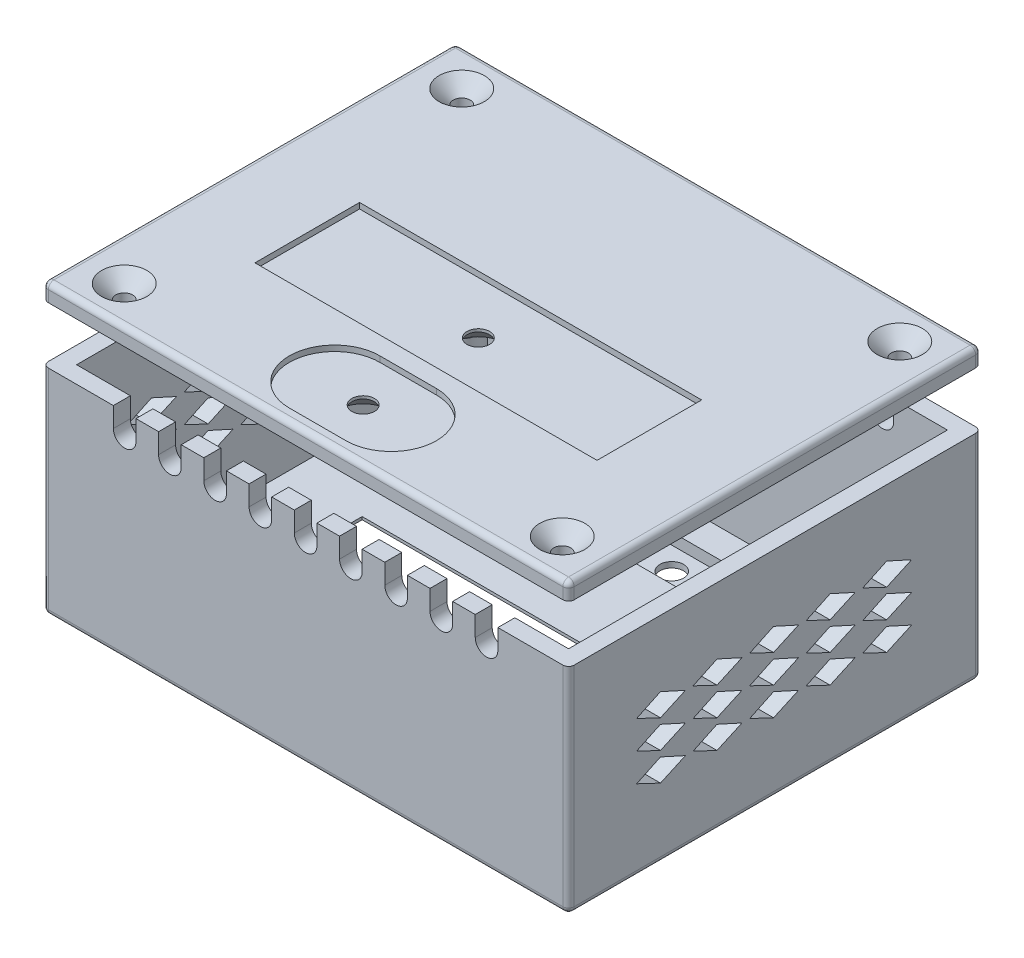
from build123d import *
from OCP.BRepFilletAPI import BRepFilletAPI_MakeChamfer

# Parameters (mm, degrees)
SKETCH_227_W            = 93
SKETCH_227_H            = 73
SKETCH_227_W_2          = 87
SKETCH_227_H_2          = 67
EXTRUDE_477_DEPTH       = 35
SKETCH_2_W              = 93
SKETCH_2_H              = 73
EXTRUDE_524_DEPTH       = 3
SKETCH_1_W              = 60
SKETCH_1_H              = 31
CUT_EXTRUDE_2861_DEPTH  = 3
EXTRUDE_3678_DEPTH      = 2
EXTRUDE_3678_DEPTH_BACK = 3
SKETCH_2_2_R            = 3
SKETCH_2_2_R_2          = 1.5
CHAMFER_3737_SIZE       = 2.5
CHAMFER_3737_SIZE2      = 3
SKETCH_1_3_W            = 28
SKETCH_1_3_H            = 8
CUT_EXTRUDE_1_DEPTH     = 2
SKETCH_1_4_R            = 2.1
CUT_EXTRUDE_2_DEPTH     = 69.698617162
SKETCH_1_5_R            = 1.25
EXTRUDE_3_DEPTH         = 5
FILLET_4_R              = 1
SKETCH_4203_R           = 3.25
SKETCH_4203_R_2         = 1.5
EXTRUDE_5_DEPTH         = 12
CUT_EXTRUDE_4_DEPTH     = 129.932152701
CUT_EXTRUDE_5_DEPTH     = 94.360859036
FILLET_2_R              = 1
SKETCH_7_W              = 93
SKETCH_7_H              = 73
SKETCH_7_R              = 1.5
EXTRUDE_7965_DEPTH      = 3
EXTRUDE_START           = -1
SKETCH_7_3_W            = 86
SKETCH_7_3_H            = 66
SKETCH_7_3_R            = 1.5
EXTRUDE_2_DEPTH         = 1
FILLET_3_R              = 1
CHAMFER_2_SIZE          = 2.5
SKETCH_4_W              = 60.5
SKETCH_4_H              = 18.5
CUT_EXTRUDE_1_2_DEPTH   = 1
SKETCH_4_3_R            = 2
CUT_EXTRUDE_2_2_DEPTH   = 5
CHAMFER_3_SIZE          = 2.5
SKETCH_8_W              = 2.198076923
SKETCH_8_H              = 1.058333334
CUT_EXTRUDE_9799_DEPTH  = 1


with BuildPart() as part:
    # Sketch 227 → Extrude 477 (new body)
    with BuildSketch(Plane(origin=(0, 0, 0), x_dir=(1, 0, 0), z_dir=(0, 1, 0))):
        Rectangle(SKETCH_227_W, SKETCH_227_H)
        Rectangle(SKETCH_227_W_2, SKETCH_227_H_2, mode=Mode.SUBTRACT)
    extrude(amount=EXTRUDE_477_DEPTH)

    # Sketch 2 → Extrude 524 (add)
    with BuildSketch(Plane(origin=(0, 0, 0), x_dir=(1, 0, 0), z_dir=(0, 1, 0))):
        Rectangle(SKETCH_2_W, SKETCH_2_H)
    extrude(amount=-EXTRUDE_524_DEPTH)

    # Sketch 1 → Cut-Extrude 2861 (cut)
    with BuildSketch(Plane.XZ):
        with Locations((0, 12)):
            Rectangle(SKETCH_1_W, SKETCH_1_H)
    extrude(amount=CUT_EXTRUDE_2861_DEPTH, mode=Mode.SUBTRACT)

    # Sketch 2 2 → Extrude 3678 (add, two sides: drawn at the far end of the back side and taken through both)
    # profile 1 of 4: a face of its own
    with BuildSketch(Plane.XZ.offset(-EXTRUDE_3678_DEPTH_BACK)):
        with Locations(Location((-32.75, -12.5, 0), (0, 0, 270))):
            Circle(SKETCH_2_2_R)
        with Locations(Location((-32.75, -12.5, 0), (0, 0, 270))):
            Circle(SKETCH_2_2_R_2, mode=Mode.SUBTRACT)
    # profile 2 of 4: a face of its own
    with BuildSketch(Plane.XZ.offset(-EXTRUDE_3678_DEPTH_BACK)):
        with Locations(Location((32.75, -12.5, 0), (0, 0, 90))):
            Circle(SKETCH_2_2_R)
        with Locations(Location((32.75, -12.5, 0), (0, 0, 90))):
            Circle(SKETCH_2_2_R_2, mode=Mode.SUBTRACT)
    # profile 3 of 4: a face of its own
    with BuildSketch(Plane.XZ.offset(-EXTRUDE_3678_DEPTH_BACK)):
        with BuildLine():
            Line((-34.471932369, 32.956613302), (-31.028067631, 32.956613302))
            ThreePointArc((-31.028067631, 32.956613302), (-32.75, 27.5), (-34.471932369, 32.956613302))
        make_face()
        with Locations(Location((-32.75, 30.5, 0), (0, 0, 270))):
            Circle(SKETCH_2_2_R_2, mode=Mode.SUBTRACT)
    # profile 4 of 4: a face of its own
    with BuildSketch(Plane.XZ.offset(-EXTRUDE_3678_DEPTH_BACK)):
        with BuildLine():
            Line((34.471932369, 32.956613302), (31.028067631, 32.956613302))
            ThreePointArc((31.028067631, 32.956613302), (32.75, 27.5), (34.471932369, 32.956613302))
        make_face()
        with Locations(Location((32.75, 30.5, 0), (0, 0, 90))):
            Circle(SKETCH_2_2_R_2, mode=Mode.SUBTRACT)
    extrude(amount=EXTRUDE_3678_DEPTH + EXTRUDE_3678_DEPTH_BACK)

    # Chamfer 3737: one chamfer whose edges measure the first distance from different faces: ONE call of the kernel's chamfer builder (chamfer() names one face for all edges)
    chamfer_3737_edges_1 = [part.edges().sort_by_distance(p)[0] for p in [
        (30, -3, 12),
    ]]
    chamfer_3737_side_1 = [part.faces().sort_by_distance(p)[0] for p in [
        (30, -1.5, 12),
    ]]
    chamfer_3737_edges_2 = [part.edges().sort_by_distance(p)[0] for p in [
        (0, -3, 27.5),
    ]]
    chamfer_3737_side_2 = [part.faces().sort_by_distance(p)[0] for p in [
        (0, -1.5, 27.5),
    ]]
    chamfer_3737_edges_3 = [part.edges().sort_by_distance(p)[0] for p in [
        (-30, -3, 12),
    ]]
    chamfer_3737_side_3 = [part.faces().sort_by_distance(p)[0] for p in [
        (-30, -1.5, 12),
    ]]
    chamfer_3737_edges_4 = [part.edges().sort_by_distance(p)[0] for p in [
        (0, -3, -3.5),
    ]]
    chamfer_3737_side_4 = [part.faces().sort_by_distance(p)[0] for p in [
        (0, -1.5, -3.5),
    ]]
    chamfer_3737 = BRepFilletAPI_MakeChamfer(part.part.solid().wrapped)
    for e in chamfer_3737_edges_1:
        chamfer_3737.Add(CHAMFER_3737_SIZE, CHAMFER_3737_SIZE2, e.wrapped, chamfer_3737_side_1[0].wrapped)  # the first distance lies on this face
    for e in chamfer_3737_edges_2:
        chamfer_3737.Add(CHAMFER_3737_SIZE, CHAMFER_3737_SIZE2, e.wrapped, chamfer_3737_side_2[0].wrapped)  # the first distance lies on this face
    for e in chamfer_3737_edges_3:
        chamfer_3737.Add(CHAMFER_3737_SIZE, CHAMFER_3737_SIZE2, e.wrapped, chamfer_3737_side_3[0].wrapped)  # the first distance lies on this face
    for e in chamfer_3737_edges_4:
        chamfer_3737.Add(CHAMFER_3737_SIZE, CHAMFER_3737_SIZE2, e.wrapped, chamfer_3737_side_4[0].wrapped)  # the first distance lies on this face
    add(Compound.cast(chamfer_3737.Shape()), mode=Mode.REPLACE)

    # Sketch 1_3 → Cut-Extrude 1 (cut)
    with BuildSketch(Plane.XZ):
        with Locations((0, -24.5)):
            Rectangle(SKETCH_1_3_W, SKETCH_1_3_H)
    extrude(amount=CUT_EXTRUDE_1_DEPTH, mode=Mode.SUBTRACT)

    # Sketch 1_4 → Cut-Extrude 2 (cut, through all)
    with BuildSketch(Plane.XZ):
        with Locations(Location((-11, -24.5, 0), (0, 0, 90))):
            Circle(SKETCH_1_4_R)
        with Locations(Location((-3.75, -24.5, 0), (0, 0, 90))):
            Circle(SKETCH_1_4_R)
        with Locations(Location((11, -24.5, 0), (0, 0, 90))):
            Circle(SKETCH_1_4_R)
        with Locations(Location((3.75, -24.5, 0), (0, 0, 90))):
            Circle(SKETCH_1_4_R)
    extrude(amount=CUT_EXTRUDE_2_DEPTH, mode=Mode.SUBTRACT)

    # Sketch 1_5 → Extrude 3 (add)
    with BuildSketch(Plane.XZ):
        with Locations(Location((-16.5, -19, 0), (0, 0, 270))):
            Circle(SKETCH_1_5_R)
        with Locations(Location((16.5, -19, 0), (0, 0, 90))):
            Circle(SKETCH_1_5_R)
        with Locations(Location((16.5, -30, 0), (0, 0, 270))):
            Circle(SKETCH_1_5_R)
        with Locations(Location((-16.5, -30, 0), (0, 0, 90))):
            Circle(SKETCH_1_5_R)
    extrude(amount=-EXTRUDE_3_DEPTH)

    # Fillet 4
    fillet_4_edges = [part.edges().sort_by_distance(p)[0] for p in [
        (16.5, 5, -28.75),
        (16.5, 5, -20.25),
        (-16.5, 5, -17.75),
        (-16.5, 5, -31.25),
    ]]
    fillet(fillet_4_edges, radius=FILLET_4_R)

    # Sketch 4203 → Extrude 5 (add)
    # profile 1 of 4: a face of its own
    with BuildSketch(Plane(origin=(0, 0, 0), x_dir=(1, 0, 0), z_dir=(0, 1, 0))):
        with Locations(Location((-38.735, 29.845, 0), (0, 0, 270))):
            Circle(SKETCH_4203_R)
        with Locations(Location((-38.735, 29.845, 0), (0, 0, 270))):
            Circle(SKETCH_4203_R_2, mode=Mode.SUBTRACT)
    # profile 2 of 4: a face of its own
    with BuildSketch(Plane(origin=(0, 0, 0), x_dir=(1, 0, 0), z_dir=(0, 1, 0))):
        with Locations(Location((38.735, 29.845, 0), (0, 0, 90))):
            Circle(SKETCH_4203_R)
        with Locations(Location((38.735, 29.845, 0), (0, 0, 270))):
            Circle(SKETCH_4203_R_2, mode=Mode.SUBTRACT)
    # profile 3 of 4: a face of its own
    with BuildSketch(Plane(origin=(0, 0, 0), x_dir=(1, 0, 0), z_dir=(0, 1, 0))):
        with Locations(Location((38.735, -29.845, 0), (0, 0, 171.304880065))):
            Circle(SKETCH_4203_R)
        with Locations(Location((38.735, -29.845, 0), (0, 0, 270))):
            Circle(SKETCH_4203_R_2, mode=Mode.SUBTRACT)
    # profile 4 of 4: a face of its own
    with BuildSketch(Plane(origin=(0, 0, 0), x_dir=(1, 0, 0), z_dir=(0, 1, 0))):
        with Locations(Location((-38.735, -29.845, 0), (0, 0, 90))):
            Circle(SKETCH_4203_R)
        with Locations(Location((-38.735, -29.845, 0), (0, 0, 270))):
            Circle(SKETCH_4203_R_2, mode=Mode.SUBTRACT)
    extrude(amount=EXTRUDE_5_DEPTH)

    # Sketch 4683 → Cut-Extrude 4 (cut, through all)
    with BuildSketch(Plane(origin=(-46.5, -46.5, 0), x_dir=(0, -1, 0), z_dir=(1, 0, 0))):
        Polygon((-57.799499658, -14.466543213), (-55.799499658, -10.243903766), (-57.799499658, -5.835537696), (-59.799499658, -10.243903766), align=None)
        Polygon((-57.799499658, -24.466543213), (-55.799499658, -20.243903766), (-57.799499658, -15.835537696), (-59.799499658, -20.243903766), align=None)
        Polygon((-62.799499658, -24.466543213), (-60.799499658, -20.243903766), (-62.799499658, -15.835537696), (-64.799499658, -20.243903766), align=None)
        Polygon((-67.799499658, -24.466543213), (-65.799499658, -20.243903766), (-67.799499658, -15.835537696), (-69.799499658, -20.243903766), align=None)
        Polygon((-62.799499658, -14.466543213), (-60.799499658, -10.243903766), (-62.799499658, -5.835537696), (-64.799499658, -10.243903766), align=None)
        Polygon((-67.799499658, -14.466543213), (-65.799499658, -10.243903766), (-67.799499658, -5.835537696), (-69.799499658, -10.243903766), align=None)
        Polygon((-57.799499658, -4.466543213), (-55.799499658, -0.243903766), (-57.799499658, 4.164462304), (-59.799499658, -0.243903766), align=None)
        Polygon((-62.799499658, -4.466543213), (-60.799499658, -0.243903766), (-62.799499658, 4.164462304), (-64.799499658, -0.243903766), align=None)
        Polygon((-67.799499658, -4.466543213), (-65.799499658, -0.243903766), (-67.799499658, 4.164462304), (-69.799499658, -0.243903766), align=None)
        Polygon((-57.799499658, 5.533456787), (-55.799499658, 9.756096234), (-57.799499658, 14.164462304), (-59.799499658, 9.756096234), align=None)
        Polygon((-62.799499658, 5.533456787), (-60.799499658, 9.756096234), (-62.799499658, 14.164462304), (-64.799499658, 9.756096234), align=None)
        Polygon((-67.799499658, 5.533456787), (-65.799499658, 9.756096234), (-67.799499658, 14.164462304), (-69.799499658, 9.756096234), align=None)
        Polygon((-57.799499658, 15.533456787), (-55.799499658, 19.756096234), (-57.799499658, 24.164462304), (-59.799499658, 19.756096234), align=None)
        Polygon((-62.799499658, 15.533456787), (-60.799499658, 19.756096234), (-62.799499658, 24.164462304), (-64.799499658, 19.756096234), align=None)
        Polygon((-67.799499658, 15.533456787), (-65.799499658, 19.756096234), (-67.799499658, 24.164462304), (-69.799499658, 19.756096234), align=None)
    extrude(amount=CUT_EXTRUDE_4_DEPTH, mode=Mode.SUBTRACT)

    # Sketch 6 → Cut-Extrude 5 (cut, through all)
    with BuildSketch(Plane(origin=(0, 0, -36.5), x_dir=(-1, 0, 0), z_dir=(0, 0, -1))):
        with BuildLine():
            Line((2, 31.480713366), (2, 35))
            Line((2, 35), (-2, 35))
            Line((-2, 35), (-2, 31.480713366))
            ThreePointArc((-2, 31.480713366), (0, 29.480713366), (2, 31.480713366))
        make_face()
        with BuildLine():
            Line((10, 31.480713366), (10, 35))
            Line((10, 35), (6, 35))
            Line((6, 35), (6, 31.480713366))
            ThreePointArc((6, 31.480713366), (8, 29.480713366), (10, 31.480713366))
        make_face()
        with BuildLine():
            Line((18, 31.480713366), (18, 35))
            Line((18, 35), (14, 35))
            Line((14, 35), (14, 31.480713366))
            ThreePointArc((14, 31.480713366), (16, 29.480713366), (18, 31.480713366))
        make_face()
        with BuildLine():
            Line((26, 31.480713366), (26, 35))
            Line((26, 35), (22, 35))
            Line((22, 35), (22, 31.480713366))
            ThreePointArc((22, 31.480713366), (24, 29.480713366), (26, 31.480713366))
        make_face()
        with BuildLine():
            Line((34, 31.480713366), (34, 35))
            Line((34, 35), (30, 35))
            Line((30, 35), (30, 31.480713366))
            ThreePointArc((30, 31.480713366), (32, 29.480713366), (34, 31.480713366))
        make_face()
        with BuildLine():
            Line((-6, 31.480713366), (-6, 35))
            Line((-6, 35), (-10, 35))
            Line((-10, 35), (-10, 31.480713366))
            ThreePointArc((-10, 31.480713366), (-8, 29.480713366), (-6, 31.480713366))
        make_face()
        with BuildLine():
            Line((-14, 31.480713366), (-14, 35))
            Line((-14, 35), (-18, 35))
            Line((-18, 35), (-18, 31.480713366))
            ThreePointArc((-18, 31.480713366), (-16, 29.480713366), (-14, 31.480713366))
        make_face()
        with BuildLine():
            Line((-22, 31.480713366), (-22, 35))
            Line((-22, 35), (-26, 35))
            Line((-26, 35), (-26, 31.480713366))
            ThreePointArc((-26, 31.480713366), (-24, 29.480713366), (-22, 31.480713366))
        make_face()
        with BuildLine():
            Line((-30, 31.480713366), (-30, 35))
            Line((-30, 35), (-34, 35))
            Line((-34, 35), (-34, 31.480713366))
            ThreePointArc((-34, 31.480713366), (-32, 29.480713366), (-30, 31.480713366))
        make_face()
    extrude(amount=-CUT_EXTRUDE_5_DEPTH, mode=Mode.SUBTRACT)

    # Fillet 2
    fillet_2_edges = [part.edges().sort_by_distance(p)[0] for p in [
        (0, -3, 36.5),
        (46.5, -3, 0),
        (-46.5, -3, 0),
        (0, -3, -36.5),
        (-46.5, 16, -36.5),
        (46.5, 16, -36.5),
        (46.5, 16, 36.5),
        (-46.5, 16, 36.5),
    ]]
    fillet(fillet_2_edges, radius=FILLET_2_R)

    # Sketch 8 → Cut-Extrude 9799 (cut)
    with BuildSketch(Plane.XZ.offset(3)):
        with Locations((-10.962688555, -15.117212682)):
            Rectangle(SKETCH_8_W, SKETCH_8_H)
        Polygon((-4.571983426, -13.855353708), (-4.571983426, -12.308558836), (-3.513650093, -12.308558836), (-3.513650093, -13.855353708), (-1.885444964, -13.855353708), (-1.885444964, -14.913687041), (-3.513650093, -14.913687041), (-3.513650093, -16.460481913), (-4.571983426, -16.460481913), (-4.571983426, -14.913687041), (-6.200188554, -14.913687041), (-6.200188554, -13.855353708), align=None)
        Polygon((1.778016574, -11.08740499), (5.197247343, -11.08740499), (5.197247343, -12.227148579), (2.917760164, -12.227148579), (2.917760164, -13.448302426), (5.197247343, -13.448302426), (5.197247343, -14.588046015), (2.917760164, -14.588046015), (2.917760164, -16.2976614), (5.197247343, -16.2976614), (5.197247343, -17.43740499), (1.778016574, -17.43740499), align=None)
        with BuildLine():
            Line((12.035708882, -11.935852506), (11.18344526, -12.715610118))
            add(Edge.make_bspline(
                [(11.18344526, -12.715610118), (11.115240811, -12.615550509), (11.008085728, -12.477394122), (10.850124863, -12.319945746), (10.73652598, -12.226881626), (10.621344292, -12.154472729), (10.469317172, -12.086967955), (10.349028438, -12.064069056), (10.270123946, -12.064328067)],
                knots=[0, 0, 0, 0, 0.31182434, 0.448432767, 0.573381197, 0.689077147, 0.797572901, 1, 1, 1, 1], degree=3))
            add(Edge.make_bspline(
                [(10.270123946, -12.064328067), (10.200756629, -12.064216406), (10.097367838, -12.07659847), (9.976136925, -12.134449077), (9.89898156, -12.189349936), (9.837949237, -12.255546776), (9.773768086, -12.346429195), (9.756826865, -12.428031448), (9.756221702, -12.480283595)],
                knots=[0, 0, 0, 0, 0.285992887, 0.416634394, 0.547379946, 0.671582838, 0.784400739, 1, 1, 1, 1], degree=3))
            add(Edge.make_bspline(
                [(9.756221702, -12.480283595), (9.755439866, -12.533591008), (9.775703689, -12.642360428), (9.828641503, -12.739272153), (9.861800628, -12.784300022)],
                knots=[0, 0, 0, 0, 0.487115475, 1, 1, 1, 1], degree=3))
            add(Edge.make_bspline(
                [(9.861800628, -12.784300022), (9.894291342, -12.827692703), (9.957541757, -12.89570312), (10.054651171, -12.994699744), (10.154583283, -13.089388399), (10.269935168, -13.199711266), (10.462336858, -13.371950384), (10.615262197, -13.508617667), (10.724240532, -13.603490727)],
                knots=[0, 0, 0, 0, 0.136349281, 0.233805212, 0.349411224, 0.48317915, 0.635966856, 1, 1, 1, 1], degree=3))
            add(Edge.make_bspline(
                [(10.724240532, -13.603490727), (10.825342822, -13.691530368), (10.970308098, -13.815212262), (11.150016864, -13.973999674), (11.261144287, -14.071853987), (11.354942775, -14.156575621), (11.447206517, -14.24283398), (11.507829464, -14.300959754), (11.542159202, -14.336183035)],
                knots=[0, 0, 0, 0, 0.366184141, 0.520457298, 0.655012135, 0.770624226, 0.865677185, 1, 1, 1, 1], degree=3))
            add(Edge.make_bspline(
                [(11.542159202, -14.336183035), (11.651612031, -14.451024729), (11.800953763, -14.624852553), (11.961298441, -14.870676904), (12.050521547, -15.046105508), (12.117801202, -15.223115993), (12.182176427, -15.469812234), (12.198660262, -15.662666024), (12.198529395, -15.792663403)],
                knots=[0, 0, 0, 0, 0.289954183, 0.417138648, 0.535255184, 0.648751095, 0.762405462, 1, 1, 1, 1], degree=3))
            add(Edge.make_bspline(
                [(12.198529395, -15.792663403), (12.200576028, -15.918626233), (12.182059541, -16.104100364), (12.128833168, -16.342979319), (12.06869062, -16.509377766), (11.995269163, -16.66867708), (11.90325735, -16.818399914), (11.795193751, -16.960060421), (11.671338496, -17.091126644), (11.534339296, -17.210059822), (11.387394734, -17.315938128), (11.229067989, -17.403349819), (11.060710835, -17.475343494), (10.882417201, -17.530731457), (10.626733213, -17.586725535), (10.427039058, -17.600475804), (10.291748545, -17.600225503)],
                knots=[0, 0, 0, 0, 0.127926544, 0.18904691, 0.248543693, 0.307607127, 0.36724766, 0.426963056, 0.488617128, 0.550391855, 0.611330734, 0.672556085, 0.734024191, 0.797340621, 0.862249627, 1, 1, 1, 1], degree=3))
            add(Edge.make_bspline(
                [(10.291748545, -17.600225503), (10.184208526, -17.600143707), (10.024968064, -17.5907372), (9.818261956, -17.556603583), (9.670805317, -17.520600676), (9.528307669, -17.474926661), (9.390763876, -17.419151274), (9.259123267, -17.352395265), (9.13238981, -17.276035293), (9.011179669, -17.187371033), (8.893959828, -17.0882156), (8.781896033, -16.977043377), (8.674444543, -16.854119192), (8.572314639, -16.719087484), (8.435743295, -16.52121715), (8.347992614, -16.359269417), (8.290837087, -16.248052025)],
                knots=[0, 0, 0, 0, 0.125868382, 0.18624025, 0.244976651, 0.303357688, 0.361230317, 0.418489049, 0.475936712, 0.534203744, 0.594059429, 0.655468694, 0.718771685, 0.784974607, 0.853522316, 1, 1, 1, 1], degree=3))
            Line((8.290837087, -16.248052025), (9.293200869, -15.646379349))
            add(Edge.make_bspline(
                [(9.293200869, -15.646379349), (9.361469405, -15.771068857), (9.472477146, -15.943744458), (9.64459515, -16.141620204), (9.773512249, -16.257263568), (9.906699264, -16.347952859), (10.088804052, -16.434136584), (10.236310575, -16.460682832), (10.333725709, -16.460481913)],
                knots=[0, 0, 0, 0, 0.307611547, 0.442138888, 0.566229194, 0.681222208, 0.789558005, 1, 1, 1, 1], degree=3))
            add(Edge.make_bspline(
                [(10.333725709, -16.460481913), (10.429502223, -16.461207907), (10.570599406, -16.439461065), (10.741352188, -16.362483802), (10.849852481, -16.282332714), (10.941544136, -16.189699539), (11.031436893, -16.054062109), (11.060144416, -15.936328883), (11.058785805, -15.858809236)],
                knots=[0, 0, 0, 0, 0.275473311, 0.404345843, 0.535429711, 0.661427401, 0.77786684, 1, 1, 1, 1], degree=3))
            add(Edge.make_bspline(
                [(11.058785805, -15.858809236), (11.058615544, -15.785005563), (11.036362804, -15.6726417), (10.972170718, -15.530138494), (10.914405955, -15.440407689), (10.855509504, -15.365283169), (10.799209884, -15.300190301), (10.730645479, -15.22827453), (10.649997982, -15.149444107), (10.558327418, -15.063009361), (10.414517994, -14.931385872), (10.298153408, -14.832067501), (10.216698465, -14.763586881)],
                knots=[0, 0, 0, 0, 0.155090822, 0.238351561, 0.32840414, 0.37938386, 0.439617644, 0.509831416, 0.588874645, 0.677436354, 0.77554672, 1, 1, 1, 1], degree=3))
            add(Edge.make_bspline(
                [(10.216698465, -14.763586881), (10.061007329, -14.633009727), (9.839520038, -14.441716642), (9.564007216, -14.188908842), (9.389855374, -14.018183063), (9.236884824, -13.861037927), (9.106114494, -13.71621255), (8.998997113, -13.582585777), (8.886241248, -13.424315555), (8.77932097, -13.231443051), (8.65738071, -12.928237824), (8.614811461, -12.691081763), (8.616478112, -12.534981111)],
                knots=[0, 0, 0, 0, 0.215201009, 0.309902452, 0.395959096, 0.473447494, 0.542140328, 0.602523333, 0.654726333, 0.747804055, 0.835278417, 1, 1, 1, 1], degree=3))
            add(Edge.make_bspline(
                [(8.616478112, -12.534981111), (8.615850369, -12.427822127), (8.631890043, -12.26894415), (8.681003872, -12.064070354), (8.73347654, -11.918190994), (8.801683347, -11.778575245), (8.88449146, -11.644537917), (8.983215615, -11.517313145), (9.094469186, -11.396985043), (9.217042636, -11.287019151), (9.34802786, -11.189962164), (9.486683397, -11.107990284), (9.632161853, -11.039974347), (9.785361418, -10.987965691), (10.001490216, -10.93783509), (10.169618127, -10.925288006), (10.282844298, -10.924584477)],
                knots=[0, 0, 0, 0, 0.12445736, 0.184840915, 0.244566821, 0.304319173, 0.365199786, 0.427420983, 0.491261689, 0.555499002, 0.618604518, 0.680494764, 0.742473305, 0.804990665, 0.868251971, 1, 1, 1, 1], degree=3))
            add(Edge.make_bspline(
                [(10.282844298, -10.924584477), (10.431940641, -10.924659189), (10.655532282, -10.952646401), (10.942314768, -11.042551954), (11.115763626, -11.123333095), (11.253772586, -11.201703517), (11.359543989, -11.273839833), (11.467170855, -11.35648161), (11.577527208, -11.449878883), (11.688537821, -11.555812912), (11.846248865, -11.714820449), (11.960539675, -11.844423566), (12.035708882, -11.935852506)],
                knots=[0, 0, 0, 0, 0.212976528, 0.319776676, 0.428556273, 0.485856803, 0.546558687, 0.611431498, 0.67982091, 0.753158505, 0.830752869, 1, 1, 1, 1], degree=3))
        make_face()
    extrude(amount=-CUT_EXTRUDE_9799_DEPTH, mode=Mode.SUBTRACT)


with BuildPart() as body_2:
    # Sketch 7 → Extrude 7965 (new body)
    with BuildSketch(Plane(origin=(0, 45, 0), x_dir=(1, 0, 0), z_dir=(0, 1, 0))):
        Rectangle(SKETCH_7_W, SKETCH_7_H)
        with Locations(Location((-38.735, 29.845, 0), (0, 0, 270))):
            Circle(SKETCH_7_R, mode=Mode.SUBTRACT)
        with Locations(Location((38.735, 29.845, 0), (0, 0, 270))):
            Circle(SKETCH_7_R, mode=Mode.SUBTRACT)
        with Locations(Location((38.735, -29.845, 0), (0, 0, 270))):
            Circle(SKETCH_7_R, mode=Mode.SUBTRACT)
        with Locations(Location((-38.735, -29.845, 0), (0, 0, 270))):
            Circle(SKETCH_7_R, mode=Mode.SUBTRACT)
    extrude(amount=EXTRUDE_7965_DEPTH)

    # Sketch 7_3 → Extrude 2 (add)
    with BuildSketch(Plane(origin=(0, 45, 0), x_dir=(1, 0, 0), z_dir=(0, 1, 0)).offset(EXTRUDE_START)):
        Rectangle(SKETCH_7_3_W, SKETCH_7_3_H)
        with Locations(Location((-38.735, 29.845, 0), (0, 0, 270))):
            Circle(SKETCH_7_3_R, mode=Mode.SUBTRACT)
        with Locations(Location((38.735, 29.845, 0), (0, 0, 270))):
            Circle(SKETCH_7_3_R, mode=Mode.SUBTRACT)
        with Locations(Location((38.735, -29.845, 0), (0, 0, 270))):
            Circle(SKETCH_7_3_R, mode=Mode.SUBTRACT)
        with Locations(Location((-38.735, -29.845, 0), (0, 0, 270))):
            Circle(SKETCH_7_3_R, mode=Mode.SUBTRACT)
    extrude(amount=EXTRUDE_2_DEPTH)

    # Fillet 3
    fillet_3_edges = [body_2.edges().sort_by_distance(p)[0] for p in [
        (0, 48, -36.5),
        (-46.5, 48, 0),
        (0, 48, 36.5),
        (-46.5, 46.5, 36.5),
        (-46.5, 46.5, -36.5),
        (46.5, 46.5, -36.5),
        (46.5, 46.5, 36.5),
        (46.5, 48, 0),
    ]]
    fillet(fillet_3_edges, radius=FILLET_3_R)

    # Chamfer 2
    chamfer_2_edges = [body_2.edges().sort_by_distance(p)[0] for p in [
        (-38.735, 48, -31.345),
        (38.735, 48, -31.345),
        (38.735, 48, 28.345),
        (-38.735, 48, 28.345),
    ]]
    chamfer(chamfer_2_edges, length=CHAMFER_2_SIZE)

    # Sketch 4 → Cut-Extrude 1 2 (cut)
    with BuildSketch(Plane(origin=(0, 48, 0), x_dir=(-1, 0, 0), z_dir=(0, 1, 0))):
        with BuildLine():
            Line((5.049026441, 18.319021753), (-4.950973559, 18.319021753))
            ThreePointArc((-4.950973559, 18.319021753), (-12.950973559, 26.319021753), (-4.950973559, 34.319021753))
            Line((-4.950973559, 34.319021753), (5.049026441, 34.319021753))
            ThreePointArc((5.049026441, 34.319021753), (13.049026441, 26.319021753), (5.049026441, 18.319021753))
        make_face()
        with Locations((0.085418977, 5.873619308)):
            Rectangle(SKETCH_4_W, SKETCH_4_H)
    extrude(amount=-CUT_EXTRUDE_1_2_DEPTH, mode=Mode.SUBTRACT)

    # Sketch 4_3 → Cut-Extrude 2 2 (cut)
    with BuildSketch(Plane(origin=(0, 48, 0), x_dir=(-1, 0, 0), z_dir=(0, 1, 0))):
        with Locations(Location((0, 26.319021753, 0), (0, 0, 90))):
            Circle(SKETCH_4_3_R)
        with Locations(Location((0.085418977, 5.873619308, 0), (0, 0, 90))):
            Circle(SKETCH_4_3_R)
    extrude(amount=-CUT_EXTRUDE_2_2_DEPTH, mode=Mode.SUBTRACT)

    # Chamfer 3
    chamfer_3_edges = [body_2.edges().sort_by_distance(p)[0] for p in [
        (-0.085418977, 44, 3.873619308),
        (0, 44, 24.319021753),
    ]]
    chamfer(chamfer_3_edges, length=CHAMFER_3_SIZE)


solid = Compound([part.part, body_2.part])
